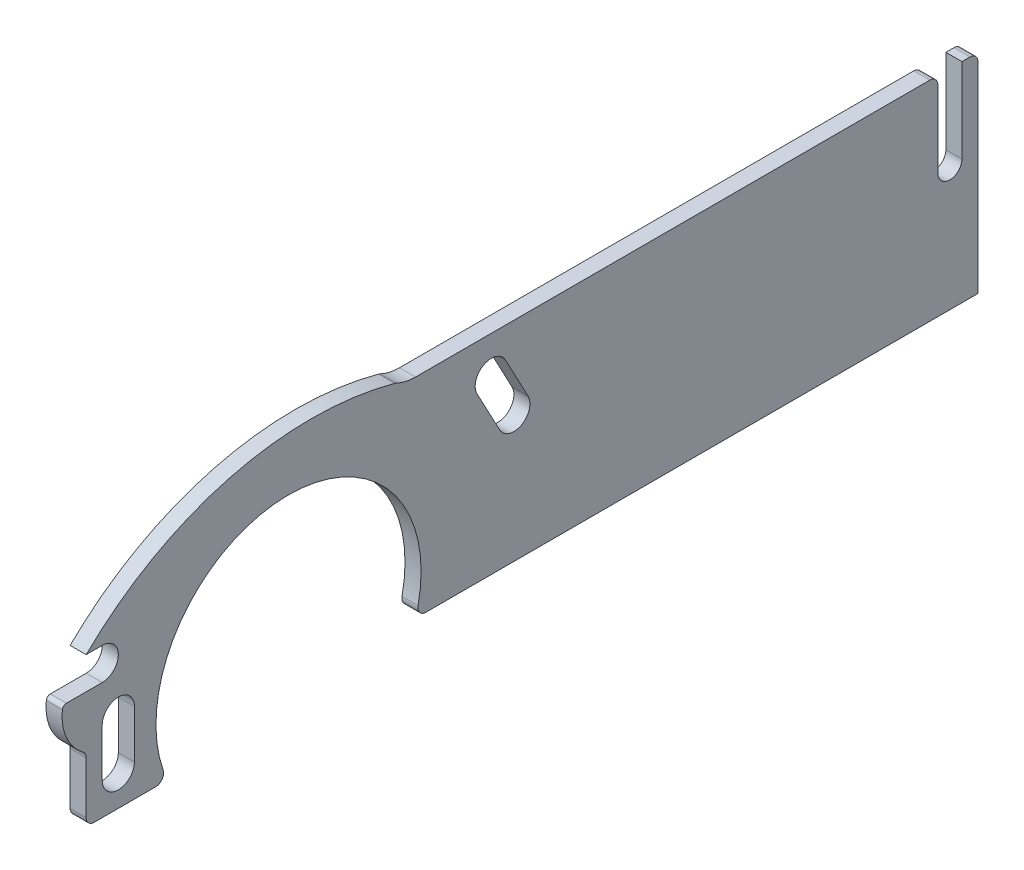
from build123d import *

# Parameters (mm, degrees)
RESSALTO_EXTRUS_O1_DEPTH = 2


with BuildPart() as part:
    # Esbo_o1 → Ressalto-extrus_o1 (new body)
    with BuildSketch(Plane(origin=(0, 0, 0), x_dir=(0, 0, -1), z_dir=(1, 0, 0))):
        with BuildLine():
            Line((0, 0), (0, 25))
            ThreePointArc((0, 25), (-0.292893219, 25.707106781), (-1, 26))
            Line((-1, 26), (-2, 26))
            Line((-2, 26), (-2, 15.5))
            ThreePointArc((-2, 15.5), (-3.5, 14), (-5, 15.5))
            Line((-5, 15.5), (-5, 25))
            ThreePointArc((-5, 25), (-5.292893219, 25.707106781), (-6, 26))
            Line((-6, 26), (-70, 26))
            ThreePointArc((-70, 26), (-71.248507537, 26.141106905), (-72.434027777, 26.557308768))
            ThreePointArc((-72.434027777, 26.557308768), (-72.519947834, 26.593984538), (-72.608915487, 26.622482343))
            ThreePointArc((-72.608915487, 26.622482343), (-93.139545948, 26.696407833), (-111, 16.571367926))
            Line((-111, 16.571367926), (-109, 16.571367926))
            ThreePointArc((-109, 16.571367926), (-107, 14.571367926), (-109, 12.571367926))
            Line((-109, 12.571367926), (-113.466213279, 12.571367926))
            ThreePointArc((-113.466213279, 12.571367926), (-113.800393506, 12.443286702), (-113.963364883, 12.124662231))
            ThreePointArc((-113.963364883, 12.124662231), (-113.460397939, 8.860641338), (-111.403723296, 6.276671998))
            ThreePointArc((-111.403723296, 6.276671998), (-111.106614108, 5.923183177), (-111, 5.473893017))
            Line((-111, 5.473893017), (-111, -1))
            ThreePointArc((-111, -1), (-110.707106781, -1.707106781), (-110, -2))
            Line((-110, -2), (-102.358378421, -2))
            ThreePointArc((-102.358378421, -2), (-101.544115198, -1.580495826), (-101.413025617, -0.673950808))
            ThreePointArc((-101.413025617, -0.673950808), (-86.793753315, 21.176788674), (-69.688908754, 1.211763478))
            ThreePointArc((-69.688908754, 1.211763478), (-69.489971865, 0.372211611), (-68.711587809, 0))
            Line((-68.711587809, 0), (0, 0))
        make_face()
        with BuildLine():
            Line((-105, 8), (-105, 2))
            ThreePointArc((-105, 2), (-107, 0), (-109, 2))
            Line((-109, 2), (-109, 8))
            ThreePointArc((-109, 8), (-107, 10), (-105, 8))
        make_face(mode=Mode.SUBTRACT)
        with BuildLine():
            Line((-58.816829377, 22.236628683), (-56, 16.938943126))
            ThreePointArc((-56, 16.938943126), (-56.82695206, 14.234104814), (-59.531790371, 15.061056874))
            Line((-59.531790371, 15.061056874), (-62.348619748, 20.358742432))
            ThreePointArc((-62.348619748, 20.358742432), (-61.521667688, 23.063580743), (-58.816829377, 22.236628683))
        make_face(mode=Mode.SUBTRACT)
    extrude(amount=RESSALTO_EXTRUS_O1_DEPTH)


solid = part.part
